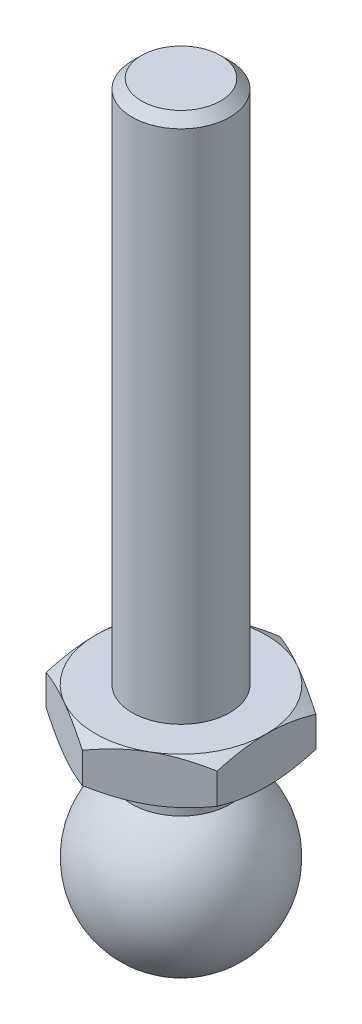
ISO-10303-21;
HEADER;
FILE_DESCRIPTION(('STEP AP214'),'2;1');
FILE_NAME('part.step','',(''),(''),'','','');
FILE_SCHEMA(('AUTOMOTIVE_DESIGN { 1 0 10303 214 1 1 1 1 }'));
ENDSEC;
DATA;
#1=APPLICATION_CONTEXT('core data for automotive mechanical design processes');
#2=APPLICATION_PROTOCOL_DEFINITION('international standard','automotive_design',2000,#1);
#3=PRODUCT_CONTEXT('',#1,'mechanical');
#4=PRODUCT('Part','Part','',(#3));
#5=PRODUCT_RELATED_PRODUCT_CATEGORY('part','',(#4));
#6=PRODUCT_DEFINITION_FORMATION('','',#4);
#7=PRODUCT_DEFINITION_CONTEXT('part definition',#1,'design');
#8=PRODUCT_DEFINITION('design','',#6,#7);
#9=PRODUCT_DEFINITION_SHAPE('','',#8);
#10=(LENGTH_UNIT() NAMED_UNIT(*) SI_UNIT(.MILLI.,.METRE.));
#11=(NAMED_UNIT(*) PLANE_ANGLE_UNIT() SI_UNIT($,.RADIAN.));
#12=(NAMED_UNIT(*) SI_UNIT($,.STERADIAN.) SOLID_ANGLE_UNIT());
#13=UNCERTAINTY_MEASURE_WITH_UNIT(LENGTH_MEASURE(1.E-05),#10,'distance_accuracy_value','');
#14=(GEOMETRIC_REPRESENTATION_CONTEXT(3) GLOBAL_UNCERTAINTY_ASSIGNED_CONTEXT((#13)) GLOBAL_UNIT_ASSIGNED_CONTEXT((#10,
#11,#12)) REPRESENTATION_CONTEXT('',''));
#15=CARTESIAN_POINT('',(0.,0.,0.));
#16=DIRECTION('',(0.,0.,1.));
#17=DIRECTION('',(1.,0.,0.));
#18=AXIS2_PLACEMENT_3D('',#15,#16,#17);
#19=CARTESIAN_POINT('',(0.,12.25,0.));
#20=DIRECTION('',(0.,-1.,0.));
#21=DIRECTION('',(0.,0.,-1.));
#22=AXIS2_PLACEMENT_3D('',#19,#20,#21);
#23=CONICAL_SURFACE('',#22,7.,1.0471975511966);
#24=CARTESIAN_POINT('',(-7.,8.18828268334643,12.1648696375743));
#25=CARTESIAN_POINT('',(-7.,8.33391573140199,11.8738003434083));
#26=CARTESIAN_POINT('',(-7.,8.47854589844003,11.5822239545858));
#27=CARTESIAN_POINT('',(-7.,8.76531569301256,10.997825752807));
#28=CARTESIAN_POINT('',(-7.,8.90745515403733,10.7050038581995));
#29=CARTESIAN_POINT('',(-7.,9.18902214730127,10.117331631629));
#30=CARTESIAN_POINT('',(-7.,9.32844364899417,9.8224784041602));
#31=CARTESIAN_POINT('',(-7.,9.60360604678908,9.23106328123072));
#32=CARTESIAN_POINT('',(-7.,9.73934701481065,8.93450141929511));
#33=CARTESIAN_POINT('',(-7.,10.0123110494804,8.32593520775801));
#34=CARTESIAN_POINT('',(-7.,10.1493254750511,8.0138369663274));
#35=CARTESIAN_POINT('',(-7.,10.4171383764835,7.38695797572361));
#36=CARTESIAN_POINT('',(-7.,10.5479365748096,7.07217710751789));
#37=CARTESIAN_POINT('',(-7.,10.8015530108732,6.43962449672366));
#38=CARTESIAN_POINT('',(-7.,10.924376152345,6.12185473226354));
#39=CARTESIAN_POINT('',(-7.,11.1599016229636,5.4826031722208));
#40=CARTESIAN_POINT('',(-7.,11.2726050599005,5.16112178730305));
#41=CARTESIAN_POINT('',(-7.,11.5099014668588,4.43821731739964));
#42=CARTESIAN_POINT('',(-7.,11.631118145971,4.03566892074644));
#43=CARTESIAN_POINT('',(-7.,11.8469740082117,3.22331060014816));
#44=CARTESIAN_POINT('',(-7.,11.9416155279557,2.81350131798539));
#45=CARTESIAN_POINT('',(-7.,12.0569999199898,2.1974256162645));
#46=CARTESIAN_POINT('',(-7.,12.0908518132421,1.99359214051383));
#47=CARTESIAN_POINT('',(-7.,12.1493191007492,1.58461613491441));
#48=CARTESIAN_POINT('',(-7.,12.1739358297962,1.37947379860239));
#49=CARTESIAN_POINT('',(-7.,12.2131968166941,0.968289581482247));
#50=CARTESIAN_POINT('',(-7.,12.2278439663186,0.762247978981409));
#51=CARTESIAN_POINT('',(-7.,12.2467021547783,0.349683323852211));
#52=CARTESIAN_POINT('',(-7.,12.2509132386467,0.143160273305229));
#53=CARTESIAN_POINT('',(-7.,12.2487493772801,-0.271082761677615));
#54=CARTESIAN_POINT('',(-7.,12.2423100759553,-0.47880240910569));
#55=CARTESIAN_POINT('',(-7.,12.2189433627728,-0.893645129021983));
#56=CARTESIAN_POINT('',(-7.,12.2020159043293,-1.10076819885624));
#57=CARTESIAN_POINT('',(-7.,12.1582124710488,-1.5140304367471));
#58=CARTESIAN_POINT('',(-7.,12.1313327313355,-1.72016920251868));
#59=CARTESIAN_POINT('',(-7.,12.0684180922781,-2.13103319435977));
#60=CARTESIAN_POINT('',(-7.,12.0323828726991,-2.33575837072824));
#61=CARTESIAN_POINT('',(-7.,11.9105686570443,-2.95437912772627));
#62=CARTESIAN_POINT('',(-7.,11.8118729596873,-3.36575077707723));
#63=CARTESIAN_POINT('',(-7.,11.5884533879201,-4.18138012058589));
#64=CARTESIAN_POINT('',(-7.,11.4637148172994,-4.58563365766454));
#65=CARTESIAN_POINT('',(-7.,11.2233248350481,-5.30320893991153));
#66=CARTESIAN_POINT('',(-7.,11.1112875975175,-5.6177595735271));
#67=CARTESIAN_POINT('',(-7.,10.8778514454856,-6.24325021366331));
#68=CARTESIAN_POINT('',(-7.,10.7564551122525,-6.55419118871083));
#69=CARTESIAN_POINT('',(-7.,10.5062070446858,-7.17328528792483));
#70=CARTESIAN_POINT('',(-7.,10.3773503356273,-7.48143638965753));
#71=CARTESIAN_POINT('',(-7.,10.1137823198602,-8.09523802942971));
#72=CARTESIAN_POINT('',(-7.,9.97907065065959,-8.40088841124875));
#73=CARTESIAN_POINT('',(-7.,9.71078407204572,-8.99716345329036));
#74=CARTESIAN_POINT('',(-7.,9.57740317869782,-9.2878756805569));
#75=CARTESIAN_POINT('',(-7.,9.30714715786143,-9.86766295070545));
#76=CARTESIAN_POINT('',(-7.,9.17027208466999,-10.1567380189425));
#77=CARTESIAN_POINT('',(-7.,8.89389786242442,-10.7329937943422));
#78=CARTESIAN_POINT('',(-7.,8.75440383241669,-11.0201769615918));
#79=CARTESIAN_POINT('',(-7.,8.47302286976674,-11.5933594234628));
#80=CARTESIAN_POINT('',(-7.,8.33113600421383,-11.879358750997));
#81=CARTESIAN_POINT('',(-7.,8.18828268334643,-12.1648696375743));
#82=B_SPLINE_CURVE_WITH_KNOTS('',3,(#24,#25,#26,#27,#28,#29,#30,#31,#32,#33,#34,#35,#36,#37,#38,
#39,#40,#41,#42,#43,#44,#45,#46,#47,#48,#49,#50,#51,#52,#53,#54,#55,#56,#57,#58,#59,#60,#61,#62,
#63,#64,#65,#66,#67,#68,#69,#70,#71,#72,#73,#74,#75,#76,#77,#78,#79,#80,#81),.UNSPECIFIED.,.F.,
.F.,(4,2,2,2,2,2,2,2,2,2,2,2,2,2,2,2,2,2,2,2,2,2,2,2,2,2,2,2,4),(0.,0.976413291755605,
1.95289161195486,2.93133423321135,3.90975772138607,4.93225217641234,5.95479223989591,
6.97669748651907,7.99849072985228,9.25906449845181,10.5195273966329,11.1392271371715,
11.7588372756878,12.3782676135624,12.9976952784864,13.6208795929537,14.2440666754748,
14.8674897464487,15.490934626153,16.7587972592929,18.027377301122,19.0289263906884,
20.0302002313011,21.0321496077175,22.0341611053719,22.9936838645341,23.9531917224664,
24.9109871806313,25.8687558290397),.UNSPECIFIED.);
#83=CARTESIAN_POINT('',(-7.,11.6247852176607,4.04145188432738));
#84=VERTEX_POINT('',#83);
#85=CARTESIAN_POINT('',(-7.,12.25,0.));
#86=VERTEX_POINT('',#85);
#87=EDGE_CURVE('E309',#84,#86,#82,.T.);
#88=ORIENTED_EDGE('',*,*,#87,.F.);
#89=CARTESIAN_POINT('',(0.0002,11.6247185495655,8.0830192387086));
#90=CARTESIAN_POINT('',(-0.153667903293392,11.6760001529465,7.99418356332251));
#91=CARTESIAN_POINT('',(-0.30810950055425,11.7249544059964,7.90501666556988));
#92=CARTESIAN_POINT('',(-0.618246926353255,11.8175672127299,7.72595873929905));
#93=CARTESIAN_POINT('',(-0.773943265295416,11.8612234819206,7.63606741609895));
#94=CARTESIAN_POINT('',(-1.24352516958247,11.9833884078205,7.36495417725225));
#95=CARTESIAN_POINT('',(-1.5592643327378,12.052874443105,7.18266208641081));
#96=CARTESIAN_POINT('',(-2.03176224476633,12.1343550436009,6.9098652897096));
#97=CARTESIAN_POINT('',(-2.18710922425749,12.1575665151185,6.82017566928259));
#98=CARTESIAN_POINT('',(-2.49850511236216,12.1964887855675,6.64039116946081));
#99=CARTESIAN_POINT('',(-2.65455395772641,12.2122002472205,6.55029632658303));
#100=CARTESIAN_POINT('',(-2.96692267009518,12.2357220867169,6.36995016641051));
#101=CARTESIAN_POINT('',(-3.12324202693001,12.2435414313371,6.27969914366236));
#102=CARTESIAN_POINT('',(-3.43601650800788,12.2511197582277,6.09911871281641));
#103=CARTESIAN_POINT('',(-3.59247162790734,12.250878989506,6.00878930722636));
#104=CARTESIAN_POINT('',(-4.02110687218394,12.2391402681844,5.76131663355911));
#105=CARTESIAN_POINT('',(-4.2931466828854,12.2194342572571,5.60425437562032));
#106=CARTESIAN_POINT('',(-4.8354194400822,12.1569465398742,5.29117305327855));
#107=CARTESIAN_POINT('',(-5.10565047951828,12.114143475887,5.13515508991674));
#108=CARTESIAN_POINT('',(-5.64901454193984,12.0071483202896,4.82144370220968));
#109=CARTESIAN_POINT('',(-5.92207900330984,11.9425029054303,4.66378986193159));
#110=CARTESIAN_POINT('',(-6.46413578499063,11.795783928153,4.35083323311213));
#111=CARTESIAN_POINT('',(-6.73313504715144,11.7137448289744,4.19552643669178));
#112=CARTESIAN_POINT('',(-7.0002,11.6247185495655,4.04133641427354));
#113=B_SPLINE_CURVE_WITH_KNOTS('',3,(#89,#90,#91,#92,#93,#94,#95,#96,#97,#98,#99,#100,#101,#102,
#103,#104,#105,#106,#107,#108,#109,#110,#111,#112),.UNSPECIFIED.,.F.,.F.,(4,2,2,2,2,2,2,2,2,2,2,
4),(0.,0.554727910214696,1.10969417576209,2.2219327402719,2.76443041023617,3.30688013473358,
3.8487128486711,4.3905288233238,5.33376515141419,6.27787517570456,7.2429241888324,
8.20607866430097),.UNSPECIFIED.);
#114=CARTESIAN_POINT('',(-3.5,12.25,6.06217782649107));
#115=VERTEX_POINT('',#114);
#116=EDGE_CURVE('E135',#115,#84,#113,.T.);
#117=ORIENTED_EDGE('',*,*,#116,.F.);
#118=CARTESIAN_POINT('',(0.,12.25,0.));
#119=DIRECTION('',(0.,-1.,0.));
#120=DIRECTION('',(0.,0.,-1.));
#121=AXIS2_PLACEMENT_3D('',#118,#119,#120);
#122=CIRCLE('',#121,7.);
#123=EDGE_CURVE('E283',#115,#86,#122,.T.);
#124=ORIENTED_EDGE('',*,*,#123,.T.);
#125=EDGE_LOOP('',(#88,#117,#124));
#126=FACE_BOUND('',#125,.T.);
#127=ADVANCED_FACE('F14',(#126),#23,.T.);
#128=CARTESIAN_POINT('',(-7.,11.6247852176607,-4.04145188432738));
#129=VERTEX_POINT('',#128);
#130=EDGE_CURVE('E193',#86,#129,#82,.T.);
#131=ORIENTED_EDGE('',*,*,#130,.F.);
#132=CARTESIAN_POINT('',(-3.5,12.25,-6.06217782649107));
#133=VERTEX_POINT('',#132);
#134=EDGE_CURVE('E195',#86,#133,#122,.T.);
#135=ORIENTED_EDGE('',*,*,#134,.T.);
#136=CARTESIAN_POINT('',(-7.0002,11.6247185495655,-4.04133641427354));
#137=CARTESIAN_POINT('',(-6.84633209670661,11.6760001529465,-4.13017208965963));
#138=CARTESIAN_POINT('',(-6.69189049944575,11.7249544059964,-4.21933898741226));
#139=CARTESIAN_POINT('',(-6.38175307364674,11.8175672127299,-4.39839691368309));
#140=CARTESIAN_POINT('',(-6.22605673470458,11.8612234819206,-4.48828823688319));
#141=CARTESIAN_POINT('',(-5.75647483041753,11.9833884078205,-4.75940147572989));
#142=CARTESIAN_POINT('',(-5.4407356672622,12.052874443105,-4.94169356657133));
#143=CARTESIAN_POINT('',(-4.96823775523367,12.1343550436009,-5.21449036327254));
#144=CARTESIAN_POINT('',(-4.81289077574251,12.1575665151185,-5.30417998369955));
#145=CARTESIAN_POINT('',(-4.50149488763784,12.1964887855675,-5.48396448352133));
#146=CARTESIAN_POINT('',(-4.34544604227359,12.2122002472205,-5.57405932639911));
#147=CARTESIAN_POINT('',(-4.03307732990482,12.2357220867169,-5.75440548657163));
#148=CARTESIAN_POINT('',(-3.87675797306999,12.2435414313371,-5.84465650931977));
#149=CARTESIAN_POINT('',(-3.56398349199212,12.2511197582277,-6.02523694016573));
#150=CARTESIAN_POINT('',(-3.40752837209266,12.250878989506,-6.11556634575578));
#151=CARTESIAN_POINT('',(-2.97889312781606,12.2391402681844,-6.36303901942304));
#152=CARTESIAN_POINT('',(-2.7068533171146,12.2194342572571,-6.52010127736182));
#153=CARTESIAN_POINT('',(-2.1645805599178,12.1569465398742,-6.83318259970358));
#154=CARTESIAN_POINT('',(-1.89434952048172,12.114143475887,-6.9892005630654));
#155=CARTESIAN_POINT('',(-1.35098545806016,12.0071483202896,-7.30291195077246));
#156=CARTESIAN_POINT('',(-1.07792099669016,11.9425029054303,-7.46056579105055));
#157=CARTESIAN_POINT('',(-0.53586421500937,11.795783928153,-7.77352241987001));
#158=CARTESIAN_POINT('',(-0.266864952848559,11.7137448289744,-7.92882921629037));
#159=CARTESIAN_POINT('',(0.000200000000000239,11.6247185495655,-8.0830192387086));
#160=B_SPLINE_CURVE_WITH_KNOTS('',3,(#136,#137,#138,#139,#140,#141,#142,#143,#144,#145,#146,
#147,#148,#149,#150,#151,#152,#153,#154,#155,#156,#157,#158,#159),.UNSPECIFIED.,.F.,.F.,(4,2,2,
2,2,2,2,2,2,2,2,4),(0.,0.554727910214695,1.10969417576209,2.2219327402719,2.76443041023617,
3.30688013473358,3.8487128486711,4.39052882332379,5.33376515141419,6.27787517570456,
7.2429241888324,8.20607866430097),.UNSPECIFIED.);
#161=EDGE_CURVE('E183',#129,#133,#160,.T.);
#162=ORIENTED_EDGE('',*,*,#161,.F.);
#163=EDGE_LOOP('',(#131,#135,#162));
#164=FACE_BOUND('',#163,.T.);
#165=ADVANCED_FACE('F192',(#164),#23,.T.);
#166=CARTESIAN_POINT('',(0.,11.6247852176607,-8.08290376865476));
#167=VERTEX_POINT('',#166);
#168=EDGE_CURVE('E197',#133,#167,#160,.T.);
#169=ORIENTED_EDGE('',*,*,#168,.F.);
#170=CARTESIAN_POINT('',(3.5,12.25,-6.06217782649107));
#171=VERTEX_POINT('',#170);
#172=EDGE_CURVE('E293',#133,#171,#122,.T.);
#173=ORIENTED_EDGE('',*,*,#172,.T.);
#174=CARTESIAN_POINT('',(-0.0002,11.6247185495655,-8.0830192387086));
#175=CARTESIAN_POINT('',(0.153667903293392,11.6760001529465,-7.99418356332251));
#176=CARTESIAN_POINT('',(0.30810950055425,11.7249544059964,-7.90501666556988));
#177=CARTESIAN_POINT('',(0.618246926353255,11.8175672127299,-7.72595873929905));
#178=CARTESIAN_POINT('',(0.773943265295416,11.8612234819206,-7.63606741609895));
#179=CARTESIAN_POINT('',(1.24352516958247,11.9833884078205,-7.36495417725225));
#180=CARTESIAN_POINT('',(1.5592643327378,12.052874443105,-7.18266208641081));
#181=CARTESIAN_POINT('',(2.03176224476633,12.1343550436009,-6.9098652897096));
#182=CARTESIAN_POINT('',(2.18710922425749,12.1575665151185,-6.82017566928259));
#183=CARTESIAN_POINT('',(2.49850511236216,12.1964887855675,-6.64039116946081));
#184=CARTESIAN_POINT('',(2.65455395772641,12.2122002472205,-6.55029632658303));
#185=CARTESIAN_POINT('',(2.96692267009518,12.2357220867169,-6.36995016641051));
#186=CARTESIAN_POINT('',(3.12324202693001,12.2435414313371,-6.27969914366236));
#187=CARTESIAN_POINT('',(3.43601650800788,12.2511197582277,-6.09911871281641));
#188=CARTESIAN_POINT('',(3.59247162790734,12.250878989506,-6.00878930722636));
#189=CARTESIAN_POINT('',(4.02110687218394,12.2391402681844,-5.76131663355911));
#190=CARTESIAN_POINT('',(4.2931466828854,12.2194342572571,-5.60425437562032));
#191=CARTESIAN_POINT('',(4.8354194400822,12.1569465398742,-5.29117305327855));
#192=CARTESIAN_POINT('',(5.10565047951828,12.114143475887,-5.13515508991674));
#193=CARTESIAN_POINT('',(5.64901454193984,12.0071483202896,-4.82144370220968));
#194=CARTESIAN_POINT('',(5.92207900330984,11.9425029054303,-4.66378986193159));
#195=CARTESIAN_POINT('',(6.46413578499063,11.795783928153,-4.35083323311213));
#196=CARTESIAN_POINT('',(6.73313504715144,11.7137448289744,-4.19552643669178));
#197=CARTESIAN_POINT('',(7.0002,11.6247185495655,-4.04133641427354));
#198=B_SPLINE_CURVE_WITH_KNOTS('',3,(#174,#175,#176,#177,#178,#179,#180,#181,#182,#183,#184,
#185,#186,#187,#188,#189,#190,#191,#192,#193,#194,#195,#196,#197),.UNSPECIFIED.,.F.,.F.,(4,2,2,
2,2,2,2,2,2,2,2,4),(0.,0.554727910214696,1.10969417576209,2.2219327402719,2.76443041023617,
3.30688013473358,3.8487128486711,4.3905288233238,5.33376515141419,6.27787517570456,
7.2429241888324,8.20607866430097),.UNSPECIFIED.);
#199=EDGE_CURVE('E243',#167,#171,#198,.T.);
#200=ORIENTED_EDGE('',*,*,#199,.F.);
#201=EDGE_LOOP('',(#169,#173,#200));
#202=FACE_BOUND('',#201,.T.);
#203=ADVANCED_FACE('F342',(#202),#23,.T.);
#204=CARTESIAN_POINT('',(7.,11.6247852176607,-4.04145188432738));
#205=VERTEX_POINT('',#204);
#206=EDGE_CURVE('E238',#171,#205,#198,.T.);
#207=ORIENTED_EDGE('',*,*,#206,.F.);
#208=CARTESIAN_POINT('',(7.,12.25,0.));
#209=VERTEX_POINT('',#208);
#210=EDGE_CURVE('E288',#171,#209,#122,.T.);
#211=ORIENTED_EDGE('',*,*,#210,.T.);
#212=CARTESIAN_POINT('',(7.,8.18828268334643,-12.1648696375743));
#213=CARTESIAN_POINT('',(7.,8.33391573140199,-11.8738003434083));
#214=CARTESIAN_POINT('',(7.,8.47854589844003,-11.5822239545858));
#215=CARTESIAN_POINT('',(7.,8.76531569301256,-10.997825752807));
#216=CARTESIAN_POINT('',(7.,8.90745515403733,-10.7050038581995));
#217=CARTESIAN_POINT('',(7.,9.18902214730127,-10.117331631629));
#218=CARTESIAN_POINT('',(7.,9.32844364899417,-9.8224784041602));
#219=CARTESIAN_POINT('',(7.,9.60360604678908,-9.23106328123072));
#220=CARTESIAN_POINT('',(7.,9.73934701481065,-8.93450141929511));
#221=CARTESIAN_POINT('',(7.,10.0123110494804,-8.32593520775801));
#222=CARTESIAN_POINT('',(7.,10.1493254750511,-8.0138369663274));
#223=CARTESIAN_POINT('',(7.,10.4171383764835,-7.38695797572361));
#224=CARTESIAN_POINT('',(7.,10.5479365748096,-7.07217710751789));
#225=CARTESIAN_POINT('',(7.,10.8015530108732,-6.43962449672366));
#226=CARTESIAN_POINT('',(7.,10.924376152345,-6.12185473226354));
#227=CARTESIAN_POINT('',(7.,11.1599016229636,-5.4826031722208));
#228=CARTESIAN_POINT('',(7.,11.2726050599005,-5.16112178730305));
#229=CARTESIAN_POINT('',(7.,11.5099014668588,-4.43821731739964));
#230=CARTESIAN_POINT('',(7.,11.631118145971,-4.03566892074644));
#231=CARTESIAN_POINT('',(7.,11.8469740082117,-3.22331060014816));
#232=CARTESIAN_POINT('',(7.,11.9416155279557,-2.81350131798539));
#233=CARTESIAN_POINT('',(7.,12.0569999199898,-2.1974256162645));
#234=CARTESIAN_POINT('',(7.,12.0908518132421,-1.99359214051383));
#235=CARTESIAN_POINT('',(7.,12.1493191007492,-1.58461613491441));
#236=CARTESIAN_POINT('',(7.,12.1739358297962,-1.37947379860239));
#237=CARTESIAN_POINT('',(7.,12.2131968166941,-0.968289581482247));
#238=CARTESIAN_POINT('',(7.,12.2278439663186,-0.762247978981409));
#239=CARTESIAN_POINT('',(7.,12.2467021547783,-0.349683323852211));
#240=CARTESIAN_POINT('',(7.,12.2509132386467,-0.143160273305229));
#241=CARTESIAN_POINT('',(7.,12.2487493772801,0.271082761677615));
#242=CARTESIAN_POINT('',(7.,12.2423100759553,0.47880240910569));
#243=CARTESIAN_POINT('',(7.,12.2189433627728,0.893645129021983));
#244=CARTESIAN_POINT('',(7.,12.2020159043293,1.10076819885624));
#245=CARTESIAN_POINT('',(7.,12.1582124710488,1.5140304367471));
#246=CARTESIAN_POINT('',(7.,12.1313327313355,1.72016920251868));
#247=CARTESIAN_POINT('',(7.,12.0684180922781,2.13103319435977));
#248=CARTESIAN_POINT('',(7.,12.0323828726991,2.33575837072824));
#249=CARTESIAN_POINT('',(7.,11.9105686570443,2.95437912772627));
#250=CARTESIAN_POINT('',(7.,11.8118729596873,3.36575077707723));
#251=CARTESIAN_POINT('',(7.,11.5884533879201,4.18138012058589));
#252=CARTESIAN_POINT('',(7.,11.4637148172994,4.58563365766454));
#253=CARTESIAN_POINT('',(7.,11.2233248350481,5.30320893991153));
#254=CARTESIAN_POINT('',(7.,11.1112875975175,5.6177595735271));
#255=CARTESIAN_POINT('',(7.,10.8778514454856,6.24325021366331));
#256=CARTESIAN_POINT('',(7.,10.7564551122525,6.55419118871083));
#257=CARTESIAN_POINT('',(7.,10.5062070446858,7.17328528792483));
#258=CARTESIAN_POINT('',(7.,10.3773503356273,7.48143638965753));
#259=CARTESIAN_POINT('',(7.,10.1137823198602,8.09523802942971));
#260=CARTESIAN_POINT('',(7.,9.97907065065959,8.40088841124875));
#261=CARTESIAN_POINT('',(7.,9.71078407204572,8.99716345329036));
#262=CARTESIAN_POINT('',(7.,9.57740317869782,9.2878756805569));
#263=CARTESIAN_POINT('',(7.,9.30714715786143,9.86766295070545));
#264=CARTESIAN_POINT('',(7.,9.17027208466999,10.1567380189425));
#265=CARTESIAN_POINT('',(7.,8.89389786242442,10.7329937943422));
#266=CARTESIAN_POINT('',(7.,8.75440383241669,11.0201769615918));
#267=CARTESIAN_POINT('',(7.,8.47302286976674,11.5933594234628));
#268=CARTESIAN_POINT('',(7.,8.33113600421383,11.879358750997));
#269=CARTESIAN_POINT('',(7.,8.18828268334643,12.1648696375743));
#270=B_SPLINE_CURVE_WITH_KNOTS('',3,(#212,#213,#214,#215,#216,#217,#218,#219,#220,#221,#222,
#223,#224,#225,#226,#227,#228,#229,#230,#231,#232,#233,#234,#235,#236,#237,#238,#239,#240,#241,
#242,#243,#244,#245,#246,#247,#248,#249,#250,#251,#252,#253,#254,#255,#256,#257,#258,#259,#260,
#261,#262,#263,#264,#265,#266,#267,#268,#269),.UNSPECIFIED.,.F.,.F.,(4,2,2,2,2,2,2,2,2,2,2,2,2,
2,2,2,2,2,2,2,2,2,2,2,2,2,2,2,4),(0.,0.976413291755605,1.95289161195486,2.93133423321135,
3.90975772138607,4.93225217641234,5.95479223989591,6.97669748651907,7.99849072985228,
9.25906449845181,10.5195273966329,11.1392271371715,11.7588372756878,12.3782676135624,
12.9976952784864,13.6208795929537,14.2440666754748,14.8674897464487,15.490934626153,
16.7587972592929,18.027377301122,19.0289263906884,20.0302002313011,21.0321496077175,
22.0341611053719,22.9936838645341,23.9531917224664,24.9109871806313,25.8687558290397),.UNSPECIFIED.);
#271=EDGE_CURVE('E249',#205,#209,#270,.T.);
#272=ORIENTED_EDGE('',*,*,#271,.F.);
#273=EDGE_LOOP('',(#207,#211,#272));
#274=FACE_BOUND('',#273,.T.);
#275=ADVANCED_FACE('F352',(#274),#23,.T.);
#276=CARTESIAN_POINT('',(7.,11.6247852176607,4.04145188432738));
#277=VERTEX_POINT('',#276);
#278=EDGE_CURVE('E251',#209,#277,#270,.T.);
#279=ORIENTED_EDGE('',*,*,#278,.F.);
#280=CARTESIAN_POINT('',(3.5,12.25,6.06217782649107));
#281=VERTEX_POINT('',#280);
#282=EDGE_CURVE('E281',#209,#281,#122,.T.);
#283=ORIENTED_EDGE('',*,*,#282,.T.);
#284=CARTESIAN_POINT('',(7.0002,11.6247185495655,4.04133641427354));
#285=CARTESIAN_POINT('',(6.84633209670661,11.6760001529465,4.13017208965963));
#286=CARTESIAN_POINT('',(6.69189049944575,11.7249544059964,4.21933898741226));
#287=CARTESIAN_POINT('',(6.38175307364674,11.8175672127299,4.39839691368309));
#288=CARTESIAN_POINT('',(6.22605673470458,11.8612234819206,4.48828823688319));
#289=CARTESIAN_POINT('',(5.75647483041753,11.9833884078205,4.75940147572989));
#290=CARTESIAN_POINT('',(5.4407356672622,12.052874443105,4.94169356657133));
#291=CARTESIAN_POINT('',(4.96823775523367,12.1343550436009,5.21449036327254));
#292=CARTESIAN_POINT('',(4.81289077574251,12.1575665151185,5.30417998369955));
#293=CARTESIAN_POINT('',(4.50149488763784,12.1964887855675,5.48396448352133));
#294=CARTESIAN_POINT('',(4.34544604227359,12.2122002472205,5.57405932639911));
#295=CARTESIAN_POINT('',(4.03307732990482,12.2357220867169,5.75440548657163));
#296=CARTESIAN_POINT('',(3.87675797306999,12.2435414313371,5.84465650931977));
#297=CARTESIAN_POINT('',(3.56398349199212,12.2511197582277,6.02523694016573));
#298=CARTESIAN_POINT('',(3.40752837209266,12.250878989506,6.11556634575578));
#299=CARTESIAN_POINT('',(2.97889312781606,12.2391402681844,6.36303901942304));
#300=CARTESIAN_POINT('',(2.7068533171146,12.2194342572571,6.52010127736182));
#301=CARTESIAN_POINT('',(2.1645805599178,12.1569465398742,6.83318259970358));
#302=CARTESIAN_POINT('',(1.89434952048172,12.114143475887,6.9892005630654));
#303=CARTESIAN_POINT('',(1.35098545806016,12.0071483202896,7.30291195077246));
#304=CARTESIAN_POINT('',(1.07792099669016,11.9425029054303,7.46056579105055));
#305=CARTESIAN_POINT('',(0.53586421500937,11.795783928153,7.77352241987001));
#306=CARTESIAN_POINT('',(0.266864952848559,11.7137448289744,7.92882921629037));
#307=CARTESIAN_POINT('',(-0.000200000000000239,11.6247185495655,8.0830192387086));
#308=B_SPLINE_CURVE_WITH_KNOTS('',3,(#284,#285,#286,#287,#288,#289,#290,#291,#292,#293,#294,
#295,#296,#297,#298,#299,#300,#301,#302,#303,#304,#305,#306,#307),.UNSPECIFIED.,.F.,.F.,(4,2,2,
2,2,2,2,2,2,2,2,4),(0.,0.554727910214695,1.10969417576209,2.2219327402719,2.76443041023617,
3.30688013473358,3.8487128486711,4.39052882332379,5.33376515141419,6.27787517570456,
7.2429241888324,8.20607866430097),.UNSPECIFIED.);
#309=EDGE_CURVE('E126',#277,#281,#308,.T.);
#310=ORIENTED_EDGE('',*,*,#309,.F.);
#311=EDGE_LOOP('',(#279,#283,#310));
#312=FACE_BOUND('',#311,.T.);
#313=ADVANCED_FACE('F285',(#312),#23,.T.);
#314=CARTESIAN_POINT('',(0.,11.6247852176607,8.08290376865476));
#315=VERTEX_POINT('',#314);
#316=EDGE_CURVE('E116',#281,#315,#308,.T.);
#317=ORIENTED_EDGE('',*,*,#316,.F.);
#318=EDGE_CURVE('E274',#281,#115,#122,.T.);
#319=ORIENTED_EDGE('',*,*,#318,.T.);
#320=EDGE_CURVE('E29',#315,#115,#113,.T.);
#321=ORIENTED_EDGE('',*,*,#320,.F.);
#322=EDGE_LOOP('',(#317,#319,#321));
#323=FACE_BOUND('',#322,.T.);
#324=ADVANCED_FACE('F273',(#323),#23,.T.);
#325=CARTESIAN_POINT('',(0.,55.25,0.));
#326=DIRECTION('',(0.,-1.,0.));
#327=DIRECTION('',(0.,0.,-1.));
#328=AXIS2_PLACEMENT_3D('',#325,#326,#327);
#329=PLANE('',#328);
#330=CARTESIAN_POINT('',(0.,55.25,0.));
#331=DIRECTION('',(0.,-1.,0.));
#332=DIRECTION('',(0.,0.,-1.));
#333=AXIS2_PLACEMENT_3D('',#330,#331,#332);
#334=CIRCLE('',#333,3.233);
#335=CARTESIAN_POINT('',(0.,55.25,-3.233));
#336=VERTEX_POINT('',#335);
#337=EDGE_CURVE('E22',#336,#336,#334,.T.);
#338=ORIENTED_EDGE('',*,*,#337,.F.);
#339=EDGE_LOOP('',(#338));
#340=FACE_BOUND('',#339,.T.);
#341=ADVANCED_FACE('F16',(#340),#329,.F.);
#342=CARTESIAN_POINT('',(0.,55.25,0.));
#343=DIRECTION('',(0.,-1.,0.));
#344=DIRECTION('',(0.,0.,-1.));
#345=AXIS2_PLACEMENT_3D('',#342,#343,#344);
#346=CONICAL_SURFACE('',#345,3.233,0.785398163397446);
#347=CARTESIAN_POINT('',(0.,54.483,0.));
#348=DIRECTION('',(0.,-1.,0.));
#349=DIRECTION('',(0.,0.,-1.));
#350=AXIS2_PLACEMENT_3D('',#347,#348,#349);
#351=CIRCLE('',#350,4.);
#352=CARTESIAN_POINT('',(0.,54.483,-4.));
#353=VERTEX_POINT('',#352);
#354=EDGE_CURVE('E290',#353,#353,#351,.T.);
#355=ORIENTED_EDGE('',*,*,#354,.F.);
#356=EDGE_LOOP('',(#355));
#357=FACE_BOUND('',#356,.T.);
#358=ORIENTED_EDGE('',*,*,#337,.T.);
#359=EDGE_LOOP('',(#358));
#360=FACE_BOUND('',#359,.T.);
#361=ADVANCED_FACE('F350',(#357,#360),#346,.T.);
#362=CARTESIAN_POINT('',(0.,-7.,0.));
#363=DIRECTION('',(0.,-1.,0.));
#364=DIRECTION('',(0.,0.,-1.));
#365=AXIS2_PLACEMENT_3D('',#362,#363,#364);
#366=CYLINDRICAL_SURFACE('',#365,4.);
#367=CARTESIAN_POINT('',(0.,12.25,0.));
#368=DIRECTION('',(0.,-1.,0.));
#369=DIRECTION('',(0.,0.,-1.));
#370=AXIS2_PLACEMENT_3D('',#367,#368,#369);
#371=CIRCLE('',#370,4.);
#372=CARTESIAN_POINT('',(0.,12.25,-4.));
#373=VERTEX_POINT('',#372);
#374=EDGE_CURVE('E287',#373,#373,#371,.T.);
#375=ORIENTED_EDGE('',*,*,#374,.F.);
#376=EDGE_LOOP('',(#375));
#377=FACE_BOUND('',#376,.T.);
#378=ORIENTED_EDGE('',*,*,#354,.T.);
#379=EDGE_LOOP('',(#378));
#380=FACE_BOUND('',#379,.T.);
#381=ADVANCED_FACE('F427',(#377,#380),#366,.T.);
#382=CARTESIAN_POINT('',(4.,12.25,0.));
#383=DIRECTION('',(0.,-1.,0.));
#384=DIRECTION('',(0.,0.,-1.));
#385=AXIS2_PLACEMENT_3D('',#382,#383,#384);
#386=PLANE('',#385);
#387=ORIENTED_EDGE('',*,*,#282,.F.);
#388=ORIENTED_EDGE('',*,*,#210,.F.);
#389=ORIENTED_EDGE('',*,*,#172,.F.);
#390=ORIENTED_EDGE('',*,*,#134,.F.);
#391=ORIENTED_EDGE('',*,*,#123,.F.);
#392=ORIENTED_EDGE('',*,*,#318,.F.);
#393=EDGE_LOOP('',(#387,#388,#389,#390,#391,#392));
#394=FACE_BOUND('',#393,.T.);
#395=ORIENTED_EDGE('',*,*,#374,.T.);
#396=EDGE_LOOP('',(#395));
#397=FACE_BOUND('',#396,.T.);
#398=ADVANCED_FACE('F278',(#394,#397),#386,.F.);
#399=CARTESIAN_POINT('',(-7.,8.5,-4.04145188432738));
#400=DIRECTION('',(-1.,0.,0.));
#401=DIRECTION('',(0.,0.,1.));
#402=AXIS2_PLACEMENT_3D('',#399,#400,#401);
#403=PLANE('',#402);
#404=ORIENTED_EDGE('',*,*,#87,.T.);
#405=ORIENTED_EDGE('',*,*,#130,.T.);
#406=DIRECTION('',(0.,1.,0.));
#407=VECTOR('',#406,1.);
#408=CARTESIAN_POINT('',(-7.,8.5,-4.04145188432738));
#409=LINE('',#408,#407);
#410=CARTESIAN_POINT('',(-7.,9.12521478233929,-4.04145188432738));
#411=VERTEX_POINT('',#410);
#412=EDGE_CURVE('E109',#411,#129,#409,.T.);
#413=ORIENTED_EDGE('',*,*,#412,.F.);
#414=CARTESIAN_POINT('',(-7.,12.5617173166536,-12.1648696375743));
#415=CARTESIAN_POINT('',(-7.,12.416084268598,-11.8738003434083));
#416=CARTESIAN_POINT('',(-7.,12.27145410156,-11.5822239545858));
#417=CARTESIAN_POINT('',(-7.,11.9846843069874,-10.997825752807));
#418=CARTESIAN_POINT('',(-7.,11.8425448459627,-10.7050038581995));
#419=CARTESIAN_POINT('',(-7.,11.5609778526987,-10.1173316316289));
#420=CARTESIAN_POINT('',(-7.,11.4215563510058,-9.82247840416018));
#421=CARTESIAN_POINT('',(-7.,11.1463939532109,-9.23106328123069));
#422=CARTESIAN_POINT('',(-7.,11.0106529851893,-8.93450141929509));
#423=CARTESIAN_POINT('',(-7.,10.7376889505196,-8.32593520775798));
#424=CARTESIAN_POINT('',(-7.,10.6006745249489,-8.01383696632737));
#425=CARTESIAN_POINT('',(-7.,10.3328616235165,-7.38695797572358));
#426=CARTESIAN_POINT('',(-7.,10.2020634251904,-7.07217710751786));
#427=CARTESIAN_POINT('',(-7.,9.94844698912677,-6.43962449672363));
#428=CARTESIAN_POINT('',(-7.,9.825623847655,-6.12185473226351));
#429=CARTESIAN_POINT('',(-7.,9.59009837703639,-5.48260317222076));
#430=CARTESIAN_POINT('',(-7.,9.47739494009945,-5.16112178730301));
#431=CARTESIAN_POINT('',(-7.,9.24009853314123,-4.4382173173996));
#432=CARTESIAN_POINT('',(-7.,9.11888185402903,-4.03566892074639));
#433=CARTESIAN_POINT('',(-7.,8.90302599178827,-3.22331060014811));
#434=CARTESIAN_POINT('',(-7.,8.80838447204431,-2.81350131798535));
#435=CARTESIAN_POINT('',(-7.,8.69300008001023,-2.19742561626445));
#436=CARTESIAN_POINT('',(-7.,8.65914818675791,-1.99359214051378));
#437=CARTESIAN_POINT('',(-7.,8.60068089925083,-1.58461613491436));
#438=CARTESIAN_POINT('',(-7.,8.5760641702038,-1.37947379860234));
#439=CARTESIAN_POINT('',(-7.,8.53680318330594,-0.968289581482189));
#440=CARTESIAN_POINT('',(-7.,8.52215603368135,-0.76224797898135));
#441=CARTESIAN_POINT('',(-7.,8.50329784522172,-0.349683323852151));
#442=CARTESIAN_POINT('',(-7.,8.49908676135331,-0.143160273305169));
#443=CARTESIAN_POINT('',(-7.,8.50125062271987,0.271082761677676));
#444=CARTESIAN_POINT('',(-7.,8.50768992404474,0.478802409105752));
#445=CARTESIAN_POINT('',(-7.,8.53105663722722,0.893645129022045));
#446=CARTESIAN_POINT('',(-7.,8.54798409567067,1.1007681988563));
#447=CARTESIAN_POINT('',(-7.,8.59178752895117,1.51403043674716));
#448=CARTESIAN_POINT('',(-7.,8.61866726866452,1.72016920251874));
#449=CARTESIAN_POINT('',(-7.,8.68158190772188,2.13103319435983));
#450=CARTESIAN_POINT('',(-7.,8.71761712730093,2.33575837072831));
#451=CARTESIAN_POINT('',(-7.,8.83943134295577,2.95437912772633));
#452=CARTESIAN_POINT('',(-7.,8.93812704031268,3.3657507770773));
#453=CARTESIAN_POINT('',(-7.,9.16154661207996,4.18138012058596));
#454=CARTESIAN_POINT('',(-7.,9.28628518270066,4.58563365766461));
#455=CARTESIAN_POINT('',(-7.,9.52667516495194,5.30320893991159));
#456=CARTESIAN_POINT('',(-7.,9.63871240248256,5.61775957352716));
#457=CARTESIAN_POINT('',(-7.,9.87214855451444,6.24325021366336));
#458=CARTESIAN_POINT('',(-7.,9.99354488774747,6.55419118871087));
#459=CARTESIAN_POINT('',(-7.,10.2437929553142,7.17328528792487));
#460=CARTESIAN_POINT('',(-7.,10.3726496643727,7.48143638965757));
#461=CARTESIAN_POINT('',(-7.,10.6362176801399,8.09523802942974));
#462=CARTESIAN_POINT('',(-7.,10.7709293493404,8.40088841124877));
#463=CARTESIAN_POINT('',(-7.,11.0392159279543,8.99716345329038));
#464=CARTESIAN_POINT('',(-7.,11.1725968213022,9.28787568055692));
#465=CARTESIAN_POINT('',(-7.,11.4428528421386,9.86766295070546));
#466=CARTESIAN_POINT('',(-7.,11.57972791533,10.1567380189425));
#467=CARTESIAN_POINT('',(-7.,11.8561021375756,10.7329937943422));
#468=CARTESIAN_POINT('',(-7.,11.9955961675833,11.0201769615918));
#469=CARTESIAN_POINT('',(-7.,12.2769771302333,11.5933594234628));
#470=CARTESIAN_POINT('',(-7.,12.4188639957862,11.879358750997));
#471=CARTESIAN_POINT('',(-7.,12.5617173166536,12.1648696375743));
#472=B_SPLINE_CURVE_WITH_KNOTS('',3,(#414,#415,#416,#417,#418,#419,#420,#421,#422,#423,#424,
#425,#426,#427,#428,#429,#430,#431,#432,#433,#434,#435,#436,#437,#438,#439,#440,#441,#442,#443,
#444,#445,#446,#447,#448,#449,#450,#451,#452,#453,#454,#455,#456,#457,#458,#459,#460,#461,#462,
#463,#464,#465,#466,#467,#468,#469,#470,#471),.UNSPECIFIED.,.F.,.F.,(4,2,2,2,2,2,2,2,2,2,2,2,2,
2,2,2,2,2,2,2,2,2,2,2,2,2,2,2,4),(0.,0.976413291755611,1.95289161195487,2.93133423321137,
3.90975772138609,4.93225217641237,5.95479223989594,6.97669748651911,7.99849072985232,
9.25906449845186,10.5195273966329,11.1392271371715,11.7588372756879,12.3782676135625,
12.9976952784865,13.6208795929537,14.2440666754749,14.8674897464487,15.490934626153,
16.758797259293,18.0273773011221,19.0289263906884,20.0302002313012,21.0321496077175,
22.0341611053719,22.9936838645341,23.9531917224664,24.9109871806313,25.8687558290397),.UNSPECIFIED.);
#473=CARTESIAN_POINT('',(-7.,8.5,0.));
#474=VERTEX_POINT('',#473);
#475=EDGE_CURVE('E199',#411,#474,#472,.T.);
#476=ORIENTED_EDGE('',*,*,#475,.T.);
#477=CARTESIAN_POINT('',(-7.,9.12521478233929,4.04145188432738));
#478=VERTEX_POINT('',#477);
#479=EDGE_CURVE('E196',#474,#478,#472,.T.);
#480=ORIENTED_EDGE('',*,*,#479,.T.);
#481=DIRECTION('',(0.,1.,0.));
#482=VECTOR('',#481,1.);
#483=CARTESIAN_POINT('',(-7.,8.5,4.04145188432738));
#484=LINE('',#483,#482);
#485=EDGE_CURVE('E118',#478,#84,#484,.T.);
#486=ORIENTED_EDGE('',*,*,#485,.T.);
#487=EDGE_LOOP('',(#404,#405,#413,#476,#480,#486));
#488=FACE_BOUND('',#487,.T.);
#489=ADVANCED_FACE('F224',(#488),#403,.T.);
#490=CARTESIAN_POINT('',(0.,8.5,-8.08290376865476));
#491=DIRECTION('',(-0.5,0.,-0.866025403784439));
#492=DIRECTION('',(-0.866025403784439,0.,0.5));
#493=AXIS2_PLACEMENT_3D('',#490,#491,#492);
#494=PLANE('',#493);
#495=ORIENTED_EDGE('',*,*,#161,.T.);
#496=ORIENTED_EDGE('',*,*,#168,.T.);
#497=DIRECTION('',(0.,1.,0.));
#498=VECTOR('',#497,1.);
#499=CARTESIAN_POINT('',(0.,8.5,-8.08290376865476));
#500=LINE('',#499,#498);
#501=CARTESIAN_POINT('',(0.,9.12521478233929,-8.08290376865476));
#502=VERTEX_POINT('',#501);
#503=EDGE_CURVE('E175',#502,#167,#500,.T.);
#504=ORIENTED_EDGE('',*,*,#503,.F.);
#505=CARTESIAN_POINT('',(0.0002,9.1252814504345,-8.0830192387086));
#506=CARTESIAN_POINT('',(-0.153667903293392,9.07399984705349,-7.99418356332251));
#507=CARTESIAN_POINT('',(-0.308109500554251,9.02504559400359,-7.90501666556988));
#508=CARTESIAN_POINT('',(-0.618246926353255,8.93243278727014,-7.72595873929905));
#509=CARTESIAN_POINT('',(-0.773943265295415,8.88877651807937,-7.63606741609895));
#510=CARTESIAN_POINT('',(-1.24352516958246,8.7666115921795,-7.36495417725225));
#511=CARTESIAN_POINT('',(-1.5592643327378,8.69712555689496,-7.18266208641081));
#512=CARTESIAN_POINT('',(-2.03176224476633,8.6156449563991,-6.9098652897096));
#513=CARTESIAN_POINT('',(-2.18710922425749,8.59243348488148,-6.82017566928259));
#514=CARTESIAN_POINT('',(-2.49850511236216,8.55351121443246,-6.64039116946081));
#515=CARTESIAN_POINT('',(-2.65455395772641,8.53779975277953,-6.55029632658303));
#516=CARTESIAN_POINT('',(-2.96692267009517,8.51427791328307,-6.36995016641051));
#517=CARTESIAN_POINT('',(-3.12324202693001,8.50645856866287,-6.27969914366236));
#518=CARTESIAN_POINT('',(-3.43601650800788,8.49888024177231,-6.09911871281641));
#519=CARTESIAN_POINT('',(-3.59247162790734,8.49912101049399,-6.00878930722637));
#520=CARTESIAN_POINT('',(-4.02110687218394,8.5108597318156,-5.76131663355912));
#521=CARTESIAN_POINT('',(-4.2931466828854,8.53056574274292,-5.60425437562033));
#522=CARTESIAN_POINT('',(-4.83541944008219,8.59305346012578,-5.29117305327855));
#523=CARTESIAN_POINT('',(-5.10565047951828,8.63585652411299,-5.13515508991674));
#524=CARTESIAN_POINT('',(-5.64901454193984,8.74285167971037,-4.82144370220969));
#525=CARTESIAN_POINT('',(-5.92207900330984,8.80749709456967,-4.66378986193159));
#526=CARTESIAN_POINT('',(-6.46413578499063,8.95421607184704,-4.35083323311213));
#527=CARTESIAN_POINT('',(-6.73313504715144,9.03625517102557,-4.19552643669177));
#528=CARTESIAN_POINT('',(-7.0002,9.1252814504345,-4.04133641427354));
#529=B_SPLINE_CURVE_WITH_KNOTS('',3,(#505,#506,#507,#508,#509,#510,#511,#512,#513,#514,#515,
#516,#517,#518,#519,#520,#521,#522,#523,#524,#525,#526,#527,#528),.UNSPECIFIED.,.F.,.F.,(4,2,2,
2,2,2,2,2,2,2,2,4),(0.,0.554727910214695,1.10969417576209,2.2219327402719,2.76443041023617,
3.30688013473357,3.8487128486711,4.39052882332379,5.33376515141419,6.27787517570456,
7.2429241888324,8.20607866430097),.UNSPECIFIED.);
#530=CARTESIAN_POINT('',(-3.5,8.5,-6.06217782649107));
#531=VERTEX_POINT('',#530);
#532=EDGE_CURVE('E201',#502,#531,#529,.T.);
#533=ORIENTED_EDGE('',*,*,#532,.T.);
#534=EDGE_CURVE('E186',#531,#411,#529,.T.);
#535=ORIENTED_EDGE('',*,*,#534,.T.);
#536=ORIENTED_EDGE('',*,*,#412,.T.);
#537=EDGE_LOOP('',(#495,#496,#504,#533,#535,#536));
#538=FACE_BOUND('',#537,.T.);
#539=ADVANCED_FACE('F182',(#538),#494,.T.);
#540=CARTESIAN_POINT('',(7.,8.5,-4.04145188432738));
#541=DIRECTION('',(0.5,0.,-0.866025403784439));
#542=DIRECTION('',(-0.866025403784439,0.,-0.5));
#543=AXIS2_PLACEMENT_3D('',#540,#541,#542);
#544=PLANE('',#543);
#545=ORIENTED_EDGE('',*,*,#199,.T.);
#546=ORIENTED_EDGE('',*,*,#206,.T.);
#547=DIRECTION('',(0.,1.,0.));
#548=VECTOR('',#547,1.);
#549=CARTESIAN_POINT('',(7.,8.5,-4.04145188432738));
#550=LINE('',#549,#548);
#551=CARTESIAN_POINT('',(7.,9.12521478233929,-4.04145188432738));
#552=VERTEX_POINT('',#551);
#553=EDGE_CURVE('E172',#552,#205,#550,.T.);
#554=ORIENTED_EDGE('',*,*,#553,.F.);
#555=CARTESIAN_POINT('',(7.0002,9.1252814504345,-4.04133641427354));
#556=CARTESIAN_POINT('',(6.84633209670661,9.07399984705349,-4.13017208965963));
#557=CARTESIAN_POINT('',(6.69189049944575,9.02504559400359,-4.21933898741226));
#558=CARTESIAN_POINT('',(6.38175307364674,8.93243278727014,-4.39839691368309));
#559=CARTESIAN_POINT('',(6.22605673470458,8.88877651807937,-4.48828823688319));
#560=CARTESIAN_POINT('',(5.75647483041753,8.7666115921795,-4.75940147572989));
#561=CARTESIAN_POINT('',(5.4407356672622,8.69712555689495,-4.94169356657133));
#562=CARTESIAN_POINT('',(4.96823775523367,8.6156449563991,-5.21449036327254));
#563=CARTESIAN_POINT('',(4.81289077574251,8.59243348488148,-5.30417998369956));
#564=CARTESIAN_POINT('',(4.50149488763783,8.55351121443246,-5.48396448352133));
#565=CARTESIAN_POINT('',(4.34544604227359,8.53779975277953,-5.57405932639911));
#566=CARTESIAN_POINT('',(4.03307732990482,8.51427791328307,-5.75440548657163));
#567=CARTESIAN_POINT('',(3.87675797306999,8.50645856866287,-5.84465650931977));
#568=CARTESIAN_POINT('',(3.56398349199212,8.49888024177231,-6.02523694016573));
#569=CARTESIAN_POINT('',(3.40752837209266,8.49912101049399,-6.11556634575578));
#570=CARTESIAN_POINT('',(2.97889312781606,8.5108597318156,-6.36303901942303));
#571=CARTESIAN_POINT('',(2.7068533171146,8.53056574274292,-6.52010127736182));
#572=CARTESIAN_POINT('',(2.1645805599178,8.59305346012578,-6.83318259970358));
#573=CARTESIAN_POINT('',(1.89434952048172,8.63585652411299,-6.9892005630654));
#574=CARTESIAN_POINT('',(1.35098545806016,8.74285167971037,-7.30291195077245));
#575=CARTESIAN_POINT('',(1.07792099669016,8.80749709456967,-7.46056579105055));
#576=CARTESIAN_POINT('',(0.535864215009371,8.95421607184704,-7.77352241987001));
#577=CARTESIAN_POINT('',(0.26686495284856,9.03625517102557,-7.92882921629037));
#578=CARTESIAN_POINT('',(-0.000200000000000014,9.1252814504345,-8.0830192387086));
#579=B_SPLINE_CURVE_WITH_KNOTS('',3,(#555,#556,#557,#558,#559,#560,#561,#562,#563,#564,#565,
#566,#567,#568,#569,#570,#571,#572,#573,#574,#575,#576,#577,#578),.UNSPECIFIED.,.F.,.F.,(4,2,2,
2,2,2,2,2,2,2,2,4),(0.,0.554727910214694,1.10969417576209,2.2219327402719,2.76443041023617,
3.30688013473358,3.8487128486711,4.39052882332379,5.33376515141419,6.27787517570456,
7.2429241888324,8.20607866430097),.UNSPECIFIED.);
#580=CARTESIAN_POINT('',(3.5,8.5,-6.06217782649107));
#581=VERTEX_POINT('',#580);
#582=EDGE_CURVE('E244',#552,#581,#579,.T.);
#583=ORIENTED_EDGE('',*,*,#582,.T.);
#584=EDGE_CURVE('E232',#581,#502,#579,.T.);
#585=ORIENTED_EDGE('',*,*,#584,.T.);
#586=ORIENTED_EDGE('',*,*,#503,.T.);
#587=EDGE_LOOP('',(#545,#546,#554,#583,#585,#586));
#588=FACE_BOUND('',#587,.T.);
#589=ADVANCED_FACE('F223',(#588),#544,.T.);
#590=CARTESIAN_POINT('',(7.,8.5,4.04145188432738));
#591=DIRECTION('',(1.,0.,0.));
#592=DIRECTION('',(0.,0.,-1.));
#593=AXIS2_PLACEMENT_3D('',#590,#591,#592);
#594=PLANE('',#593);
#595=ORIENTED_EDGE('',*,*,#271,.T.);
#596=ORIENTED_EDGE('',*,*,#278,.T.);
#597=DIRECTION('',(0.,1.,0.));
#598=VECTOR('',#597,1.);
#599=CARTESIAN_POINT('',(7.,8.5,4.04145188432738));
#600=LINE('',#599,#598);
#601=CARTESIAN_POINT('',(7.,9.12521478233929,4.04145188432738));
#602=VERTEX_POINT('',#601);
#603=EDGE_CURVE('E117',#602,#277,#600,.T.);
#604=ORIENTED_EDGE('',*,*,#603,.F.);
#605=CARTESIAN_POINT('',(7.,12.5617173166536,12.1648696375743));
#606=CARTESIAN_POINT('',(7.,12.416084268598,11.8738003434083));
#607=CARTESIAN_POINT('',(7.,12.27145410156,11.5822239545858));
#608=CARTESIAN_POINT('',(7.,11.9846843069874,10.997825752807));
#609=CARTESIAN_POINT('',(7.,11.8425448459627,10.7050038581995));
#610=CARTESIAN_POINT('',(7.,11.5609778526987,10.1173316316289));
#611=CARTESIAN_POINT('',(7.,11.4215563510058,9.82247840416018));
#612=CARTESIAN_POINT('',(7.,11.1463939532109,9.23106328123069));
#613=CARTESIAN_POINT('',(7.,11.0106529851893,8.93450141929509));
#614=CARTESIAN_POINT('',(7.,10.7376889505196,8.32593520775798));
#615=CARTESIAN_POINT('',(7.,10.6006745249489,8.01383696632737));
#616=CARTESIAN_POINT('',(7.,10.3328616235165,7.38695797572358));
#617=CARTESIAN_POINT('',(7.,10.2020634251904,7.07217710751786));
#618=CARTESIAN_POINT('',(7.,9.94844698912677,6.43962449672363));
#619=CARTESIAN_POINT('',(7.,9.825623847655,6.12185473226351));
#620=CARTESIAN_POINT('',(7.,9.59009837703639,5.48260317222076));
#621=CARTESIAN_POINT('',(7.,9.47739494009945,5.16112178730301));
#622=CARTESIAN_POINT('',(7.,9.24009853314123,4.4382173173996));
#623=CARTESIAN_POINT('',(7.,9.11888185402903,4.03566892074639));
#624=CARTESIAN_POINT('',(7.,8.90302599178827,3.22331060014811));
#625=CARTESIAN_POINT('',(7.,8.80838447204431,2.81350131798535));
#626=CARTESIAN_POINT('',(7.,8.69300008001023,2.19742561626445));
#627=CARTESIAN_POINT('',(7.,8.65914818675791,1.99359214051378));
#628=CARTESIAN_POINT('',(7.,8.60068089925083,1.58461613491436));
#629=CARTESIAN_POINT('',(7.,8.5760641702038,1.37947379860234));
#630=CARTESIAN_POINT('',(7.,8.53680318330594,0.968289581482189));
#631=CARTESIAN_POINT('',(7.,8.52215603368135,0.76224797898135));
#632=CARTESIAN_POINT('',(7.,8.50329784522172,0.349683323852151));
#633=CARTESIAN_POINT('',(7.,8.49908676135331,0.143160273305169));
#634=CARTESIAN_POINT('',(7.,8.50125062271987,-0.271082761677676));
#635=CARTESIAN_POINT('',(7.,8.50768992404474,-0.478802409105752));
#636=CARTESIAN_POINT('',(7.,8.53105663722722,-0.893645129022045));
#637=CARTESIAN_POINT('',(7.,8.54798409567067,-1.1007681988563));
#638=CARTESIAN_POINT('',(7.,8.59178752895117,-1.51403043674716));
#639=CARTESIAN_POINT('',(7.,8.61866726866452,-1.72016920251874));
#640=CARTESIAN_POINT('',(7.,8.68158190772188,-2.13103319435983));
#641=CARTESIAN_POINT('',(7.,8.71761712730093,-2.33575837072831));
#642=CARTESIAN_POINT('',(7.,8.83943134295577,-2.95437912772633));
#643=CARTESIAN_POINT('',(7.,8.93812704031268,-3.3657507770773));
#644=CARTESIAN_POINT('',(7.,9.16154661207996,-4.18138012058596));
#645=CARTESIAN_POINT('',(7.,9.28628518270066,-4.58563365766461));
#646=CARTESIAN_POINT('',(7.,9.52667516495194,-5.30320893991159));
#647=CARTESIAN_POINT('',(7.,9.63871240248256,-5.61775957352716));
#648=CARTESIAN_POINT('',(7.,9.87214855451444,-6.24325021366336));
#649=CARTESIAN_POINT('',(7.,9.99354488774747,-6.55419118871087));
#650=CARTESIAN_POINT('',(7.,10.2437929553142,-7.17328528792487));
#651=CARTESIAN_POINT('',(7.,10.3726496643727,-7.48143638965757));
#652=CARTESIAN_POINT('',(7.,10.6362176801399,-8.09523802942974));
#653=CARTESIAN_POINT('',(7.,10.7709293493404,-8.40088841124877));
#654=CARTESIAN_POINT('',(7.,11.0392159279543,-8.99716345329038));
#655=CARTESIAN_POINT('',(7.,11.1725968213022,-9.28787568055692));
#656=CARTESIAN_POINT('',(7.,11.4428528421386,-9.86766295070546));
#657=CARTESIAN_POINT('',(7.,11.57972791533,-10.1567380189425));
#658=CARTESIAN_POINT('',(7.,11.8561021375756,-10.7329937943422));
#659=CARTESIAN_POINT('',(7.,11.9955961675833,-11.0201769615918));
#660=CARTESIAN_POINT('',(7.,12.2769771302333,-11.5933594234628));
#661=CARTESIAN_POINT('',(7.,12.4188639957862,-11.879358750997));
#662=CARTESIAN_POINT('',(7.,12.5617173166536,-12.1648696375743));
#663=B_SPLINE_CURVE_WITH_KNOTS('',3,(#605,#606,#607,#608,#609,#610,#611,#612,#613,#614,#615,
#616,#617,#618,#619,#620,#621,#622,#623,#624,#625,#626,#627,#628,#629,#630,#631,#632,#633,#634,
#635,#636,#637,#638,#639,#640,#641,#642,#643,#644,#645,#646,#647,#648,#649,#650,#651,#652,#653,
#654,#655,#656,#657,#658,#659,#660,#661,#662),.UNSPECIFIED.,.F.,.F.,(4,2,2,2,2,2,2,2,2,2,2,2,2,
2,2,2,2,2,2,2,2,2,2,2,2,2,2,2,4),(0.,0.976413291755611,1.95289161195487,2.93133423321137,
3.90975772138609,4.93225217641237,5.95479223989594,6.97669748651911,7.99849072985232,
9.25906449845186,10.5195273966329,11.1392271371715,11.7588372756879,12.3782676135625,
12.9976952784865,13.6208795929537,14.2440666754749,14.8674897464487,15.490934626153,
16.758797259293,18.0273773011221,19.0289263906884,20.0302002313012,21.0321496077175,
22.0341611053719,22.9936838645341,23.9531917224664,24.9109871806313,25.8687558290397),.UNSPECIFIED.);
#664=CARTESIAN_POINT('',(7.,8.5,0.));
#665=VERTEX_POINT('',#664);
#666=EDGE_CURVE('E255',#602,#665,#663,.T.);
#667=ORIENTED_EDGE('',*,*,#666,.T.);
#668=EDGE_CURVE('E260',#665,#552,#663,.T.);
#669=ORIENTED_EDGE('',*,*,#668,.T.);
#670=ORIENTED_EDGE('',*,*,#553,.T.);
#671=EDGE_LOOP('',(#595,#596,#604,#667,#669,#670));
#672=FACE_BOUND('',#671,.T.);
#673=ADVANCED_FACE('F153',(#672),#594,.T.);
#674=CARTESIAN_POINT('',(0.,8.5,8.08290376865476));
#675=DIRECTION('',(0.5,0.,0.866025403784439));
#676=DIRECTION('',(0.866025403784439,0.,-0.5));
#677=AXIS2_PLACEMENT_3D('',#674,#675,#676);
#678=PLANE('',#677);
#679=ORIENTED_EDGE('',*,*,#309,.T.);
#680=ORIENTED_EDGE('',*,*,#316,.T.);
#681=DIRECTION('',(0.,1.,0.));
#682=VECTOR('',#681,1.);
#683=CARTESIAN_POINT('',(0.,8.5,8.08290376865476));
#684=LINE('',#683,#682);
#685=CARTESIAN_POINT('',(0.,9.12521478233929,8.08290376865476));
#686=VERTEX_POINT('',#685);
#687=EDGE_CURVE('E104',#686,#315,#684,.T.);
#688=ORIENTED_EDGE('',*,*,#687,.F.);
#689=CARTESIAN_POINT('',(-0.0002,9.1252814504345,8.0830192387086));
#690=CARTESIAN_POINT('',(0.153667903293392,9.07399984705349,7.99418356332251));
#691=CARTESIAN_POINT('',(0.308109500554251,9.02504559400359,7.90501666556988));
#692=CARTESIAN_POINT('',(0.618246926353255,8.93243278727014,7.72595873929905));
#693=CARTESIAN_POINT('',(0.773943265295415,8.88877651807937,7.63606741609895));
#694=CARTESIAN_POINT('',(1.24352516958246,8.7666115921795,7.36495417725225));
#695=CARTESIAN_POINT('',(1.5592643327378,8.69712555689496,7.18266208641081));
#696=CARTESIAN_POINT('',(2.03176224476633,8.6156449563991,6.9098652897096));
#697=CARTESIAN_POINT('',(2.18710922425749,8.59243348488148,6.82017566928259));
#698=CARTESIAN_POINT('',(2.49850511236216,8.55351121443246,6.64039116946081));
#699=CARTESIAN_POINT('',(2.65455395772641,8.53779975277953,6.55029632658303));
#700=CARTESIAN_POINT('',(2.96692267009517,8.51427791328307,6.36995016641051));
#701=CARTESIAN_POINT('',(3.12324202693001,8.50645856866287,6.27969914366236));
#702=CARTESIAN_POINT('',(3.43601650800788,8.49888024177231,6.09911871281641));
#703=CARTESIAN_POINT('',(3.59247162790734,8.49912101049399,6.00878930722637));
#704=CARTESIAN_POINT('',(4.02110687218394,8.5108597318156,5.76131663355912));
#705=CARTESIAN_POINT('',(4.2931466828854,8.53056574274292,5.60425437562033));
#706=CARTESIAN_POINT('',(4.83541944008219,8.59305346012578,5.29117305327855));
#707=CARTESIAN_POINT('',(5.10565047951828,8.63585652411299,5.13515508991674));
#708=CARTESIAN_POINT('',(5.64901454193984,8.74285167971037,4.82144370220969));
#709=CARTESIAN_POINT('',(5.92207900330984,8.80749709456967,4.66378986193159));
#710=CARTESIAN_POINT('',(6.46413578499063,8.95421607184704,4.35083323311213));
#711=CARTESIAN_POINT('',(6.73313504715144,9.03625517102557,4.19552643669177));
#712=CARTESIAN_POINT('',(7.0002,9.1252814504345,4.04133641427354));
#713=B_SPLINE_CURVE_WITH_KNOTS('',3,(#689,#690,#691,#692,#693,#694,#695,#696,#697,#698,#699,
#700,#701,#702,#703,#704,#705,#706,#707,#708,#709,#710,#711,#712),.UNSPECIFIED.,.F.,.F.,(4,2,2,
2,2,2,2,2,2,2,2,4),(0.,0.554727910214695,1.10969417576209,2.2219327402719,2.76443041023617,
3.30688013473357,3.8487128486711,4.39052882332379,5.33376515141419,6.27787517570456,
7.2429241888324,8.20607866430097),.UNSPECIFIED.);
#714=CARTESIAN_POINT('',(3.5,8.5,6.06217782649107));
#715=VERTEX_POINT('',#714);
#716=EDGE_CURVE('E113',#686,#715,#713,.T.);
#717=ORIENTED_EDGE('',*,*,#716,.T.);
#718=EDGE_CURVE('E124',#715,#602,#713,.T.);
#719=ORIENTED_EDGE('',*,*,#718,.T.);
#720=ORIENTED_EDGE('',*,*,#603,.T.);
#721=EDGE_LOOP('',(#679,#680,#688,#717,#719,#720));
#722=FACE_BOUND('',#721,.T.);
#723=ADVANCED_FACE('F112',(#722),#678,.T.);
#724=CARTESIAN_POINT('',(-7.,8.5,4.04145188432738));
#725=DIRECTION('',(-0.5,0.,0.866025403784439));
#726=DIRECTION('',(0.866025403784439,0.,0.5));
#727=AXIS2_PLACEMENT_3D('',#724,#725,#726);
#728=PLANE('',#727);
#729=ORIENTED_EDGE('',*,*,#320,.T.);
#730=ORIENTED_EDGE('',*,*,#116,.T.);
#731=ORIENTED_EDGE('',*,*,#485,.F.);
#732=CARTESIAN_POINT('',(-7.0002,9.1252814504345,4.04133641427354));
#733=CARTESIAN_POINT('',(-6.84633209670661,9.07399984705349,4.13017208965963));
#734=CARTESIAN_POINT('',(-6.69189049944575,9.02504559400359,4.21933898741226));
#735=CARTESIAN_POINT('',(-6.38175307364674,8.93243278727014,4.39839691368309));
#736=CARTESIAN_POINT('',(-6.22605673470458,8.88877651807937,4.48828823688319));
#737=CARTESIAN_POINT('',(-5.75647483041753,8.7666115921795,4.75940147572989));
#738=CARTESIAN_POINT('',(-5.4407356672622,8.69712555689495,4.94169356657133));
#739=CARTESIAN_POINT('',(-4.96823775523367,8.6156449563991,5.21449036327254));
#740=CARTESIAN_POINT('',(-4.81289077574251,8.59243348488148,5.30417998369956));
#741=CARTESIAN_POINT('',(-4.50149488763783,8.55351121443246,5.48396448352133));
#742=CARTESIAN_POINT('',(-4.34544604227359,8.53779975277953,5.57405932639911));
#743=CARTESIAN_POINT('',(-4.03307732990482,8.51427791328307,5.75440548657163));
#744=CARTESIAN_POINT('',(-3.87675797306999,8.50645856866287,5.84465650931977));
#745=CARTESIAN_POINT('',(-3.56398349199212,8.49888024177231,6.02523694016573));
#746=CARTESIAN_POINT('',(-3.40752837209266,8.49912101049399,6.11556634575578));
#747=CARTESIAN_POINT('',(-2.97889312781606,8.5108597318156,6.36303901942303));
#748=CARTESIAN_POINT('',(-2.7068533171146,8.53056574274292,6.52010127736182));
#749=CARTESIAN_POINT('',(-2.1645805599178,8.59305346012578,6.83318259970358));
#750=CARTESIAN_POINT('',(-1.89434952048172,8.63585652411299,6.9892005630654));
#751=CARTESIAN_POINT('',(-1.35098545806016,8.74285167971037,7.30291195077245));
#752=CARTESIAN_POINT('',(-1.07792099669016,8.80749709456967,7.46056579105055));
#753=CARTESIAN_POINT('',(-0.535864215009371,8.95421607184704,7.77352241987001));
#754=CARTESIAN_POINT('',(-0.26686495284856,9.03625517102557,7.92882921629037));
#755=CARTESIAN_POINT('',(0.000200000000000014,9.1252814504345,8.0830192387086));
#756=B_SPLINE_CURVE_WITH_KNOTS('',3,(#732,#733,#734,#735,#736,#737,#738,#739,#740,#741,#742,
#743,#744,#745,#746,#747,#748,#749,#750,#751,#752,#753,#754,#755),.UNSPECIFIED.,.F.,.F.,(4,2,2,
2,2,2,2,2,2,2,2,4),(0.,0.554727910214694,1.10969417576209,2.2219327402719,2.76443041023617,
3.30688013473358,3.8487128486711,4.39052882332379,5.33376515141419,6.27787517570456,
7.2429241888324,8.20607866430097),.UNSPECIFIED.);
#757=CARTESIAN_POINT('',(-3.5,8.5,6.06217782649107));
#758=VERTEX_POINT('',#757);
#759=EDGE_CURVE('E36',#478,#758,#756,.T.);
#760=ORIENTED_EDGE('',*,*,#759,.T.);
#761=EDGE_CURVE('E101',#758,#686,#756,.T.);
#762=ORIENTED_EDGE('',*,*,#761,.T.);
#763=ORIENTED_EDGE('',*,*,#687,.T.);
#764=EDGE_LOOP('',(#729,#730,#731,#760,#762,#763));
#765=FACE_BOUND('',#764,.T.);
#766=ADVANCED_FACE('F103',(#765),#728,.T.);
#767=CARTESIAN_POINT('',(0.,0.,0.));
#768=DIRECTION('',(0.,-1.,0.));
#769=DIRECTION('',(-1.,0.,0.));
#770=AXIS2_PLACEMENT_3D('',#767,#768,#769);
#771=SPHERICAL_SURFACE('',#770,7.);
#772=CARTESIAN_POINT('',(0.,5.74456264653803,0.));
#773=DIRECTION('',(0.,-1.,0.));
#774=DIRECTION('',(0.,0.,-1.));
#775=AXIS2_PLACEMENT_3D('',#772,#773,#774);
#776=CIRCLE('',#775,4.);
#777=CARTESIAN_POINT('',(0.,5.74456264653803,-4.));
#778=VERTEX_POINT('',#777);
#779=EDGE_CURVE('E9',#778,#778,#776,.F.);
#780=ORIENTED_EDGE('',*,*,#779,.F.);
#781=EDGE_LOOP('',(#780));
#782=FACE_BOUND('',#781,.T.);
#783=ADVANCED_FACE('F160',(#782),#771,.T.);
#784=CARTESIAN_POINT('',(0.,-7.,0.));
#785=DIRECTION('',(0.,-1.,0.));
#786=DIRECTION('',(0.,0.,-1.));
#787=AXIS2_PLACEMENT_3D('',#784,#785,#786);
#788=CYLINDRICAL_SURFACE('',#787,4.);
#789=ORIENTED_EDGE('',*,*,#779,.T.);
#790=EDGE_LOOP('',(#789));
#791=FACE_BOUND('',#790,.T.);
#792=CARTESIAN_POINT('',(0.,8.5,0.));
#793=DIRECTION('',(0.,-1.,0.));
#794=DIRECTION('',(0.,0.,-1.));
#795=AXIS2_PLACEMENT_3D('',#792,#793,#794);
#796=CIRCLE('',#795,4.);
#797=CARTESIAN_POINT('',(0.,8.5,-4.));
#798=VERTEX_POINT('',#797);
#799=EDGE_CURVE('E304',#798,#798,#796,.T.);
#800=ORIENTED_EDGE('',*,*,#799,.T.);
#801=EDGE_LOOP('',(#800));
#802=FACE_BOUND('',#801,.T.);
#803=ADVANCED_FACE('F369',(#791,#802),#788,.T.);
#804=CARTESIAN_POINT('',(0.,9.30829037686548,0.));
#805=DIRECTION('',(0.,1.,0.));
#806=DIRECTION('',(0.,0.,1.));
#807=AXIS2_PLACEMENT_3D('',#804,#805,#806);
#808=CONICAL_SURFACE('',#807,8.4,1.0471975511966);
#809=ORIENTED_EDGE('',*,*,#582,.F.);
#810=ORIENTED_EDGE('',*,*,#668,.F.);
#811=CARTESIAN_POINT('',(0.,8.5,0.));
#812=DIRECTION('',(0.,-1.,0.));
#813=DIRECTION('',(0.,0.,-1.));
#814=AXIS2_PLACEMENT_3D('',#811,#812,#813);
#815=CIRCLE('',#814,7.);
#816=EDGE_CURVE('E297',#581,#665,#815,.T.);
#817=ORIENTED_EDGE('',*,*,#816,.F.);
#818=EDGE_LOOP('',(#809,#810,#817));
#819=FACE_BOUND('',#818,.T.);
#820=ADVANCED_FACE('F147',(#819),#808,.T.);
#821=ORIENTED_EDGE('',*,*,#584,.F.);
#822=EDGE_CURVE('E303',#531,#581,#815,.T.);
#823=ORIENTED_EDGE('',*,*,#822,.F.);
#824=ORIENTED_EDGE('',*,*,#532,.F.);
#825=EDGE_LOOP('',(#821,#823,#824));
#826=FACE_BOUND('',#825,.T.);
#827=ADVANCED_FACE('F366',(#826),#808,.T.);
#828=ORIENTED_EDGE('',*,*,#534,.F.);
#829=EDGE_CURVE('E307',#474,#531,#815,.T.);
#830=ORIENTED_EDGE('',*,*,#829,.F.);
#831=ORIENTED_EDGE('',*,*,#475,.F.);
#832=EDGE_LOOP('',(#828,#830,#831));
#833=FACE_BOUND('',#832,.T.);
#834=ADVANCED_FACE('F323',(#833),#808,.T.);
#835=ORIENTED_EDGE('',*,*,#479,.F.);
#836=EDGE_CURVE('E301',#758,#474,#815,.T.);
#837=ORIENTED_EDGE('',*,*,#836,.F.);
#838=ORIENTED_EDGE('',*,*,#759,.F.);
#839=EDGE_LOOP('',(#835,#837,#838));
#840=FACE_BOUND('',#839,.T.);
#841=ADVANCED_FACE('F320',(#840),#808,.T.);
#842=ORIENTED_EDGE('',*,*,#666,.F.);
#843=ORIENTED_EDGE('',*,*,#718,.F.);
#844=EDGE_CURVE('E294',#665,#715,#815,.T.);
#845=ORIENTED_EDGE('',*,*,#844,.F.);
#846=EDGE_LOOP('',(#842,#843,#845));
#847=FACE_BOUND('',#846,.T.);
#848=ADVANCED_FACE('F327',(#847),#808,.T.);
#849=CARTESIAN_POINT('',(7.,8.5,0.));
#850=DIRECTION('',(0.,1.,0.));
#851=DIRECTION('',(0.,0.,1.));
#852=AXIS2_PLACEMENT_3D('',#849,#850,#851);
#853=PLANE('',#852);
#854=ORIENTED_EDGE('',*,*,#799,.F.);
#855=EDGE_LOOP('',(#854));
#856=FACE_BOUND('',#855,.T.);
#857=ORIENTED_EDGE('',*,*,#816,.T.);
#858=ORIENTED_EDGE('',*,*,#844,.T.);
#859=EDGE_CURVE('E122',#715,#758,#815,.T.);
#860=ORIENTED_EDGE('',*,*,#859,.T.);
#861=ORIENTED_EDGE('',*,*,#836,.T.);
#862=ORIENTED_EDGE('',*,*,#829,.T.);
#863=ORIENTED_EDGE('',*,*,#822,.T.);
#864=EDGE_LOOP('',(#857,#858,#860,#861,#862,#863));
#865=FACE_BOUND('',#864,.T.);
#866=ADVANCED_FACE('F325',(#856,#865),#853,.F.);
#867=ORIENTED_EDGE('',*,*,#716,.F.);
#868=ORIENTED_EDGE('',*,*,#761,.F.);
#869=ORIENTED_EDGE('',*,*,#859,.F.);
#870=EDGE_LOOP('',(#867,#868,#869));
#871=FACE_BOUND('',#870,.T.);
#872=ADVANCED_FACE('F120',(#871),#808,.T.);
#873=CLOSED_SHELL('',(#127,#165,#203,#275,#313,#324,#341,#361,#381,#398,#489,#539,#589,#673,
#723,#766,#783,#803,#820,#827,#834,#841,#848,#866,#872));
#874=MANIFOLD_SOLID_BREP('B1',#873);
#875=ADVANCED_BREP_SHAPE_REPRESENTATION('',(#18,#874),#14);
#876=SHAPE_DEFINITION_REPRESENTATION(#9,#875);
ENDSEC;
END-ISO-10303-21;
